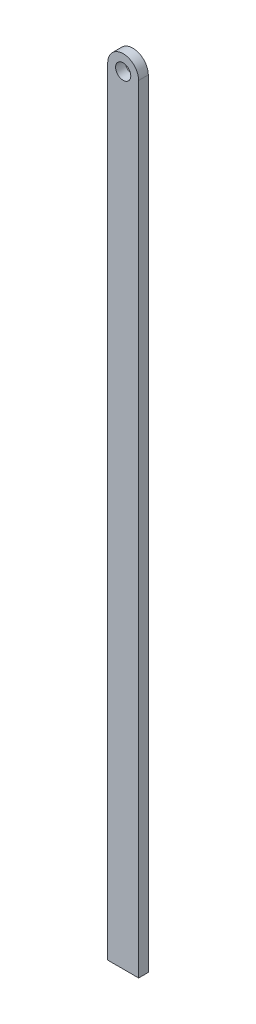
from build123d import *

# Parameters (mm, degrees)
SKETCH1_R           = 0.6
BOSS_EXTRUDE1_DEPTH = 0.762


with BuildPart() as part:
    # Sketch1 → Boss-Extrude1 (new body)
    with BuildSketch(Plane.XY):
        with BuildLine():
            Line((-13.229501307, 0), (-13.229501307, -61.338530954))
            Line((-13.229501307, -61.338530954), (-15.670498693, -61.338530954))
            Line((-15.670498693, -61.338530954), (-15.670498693, 0))
            ThreePointArc((-15.670498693, 0), (-14.45, 1.220498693), (-13.229501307, 0))
        make_face()
        with Locations((-14.45, 0)):
            Circle(SKETCH1_R, mode=Mode.SUBTRACT)
    extrude(amount=BOSS_EXTRUDE1_DEPTH)


solid = part.part
